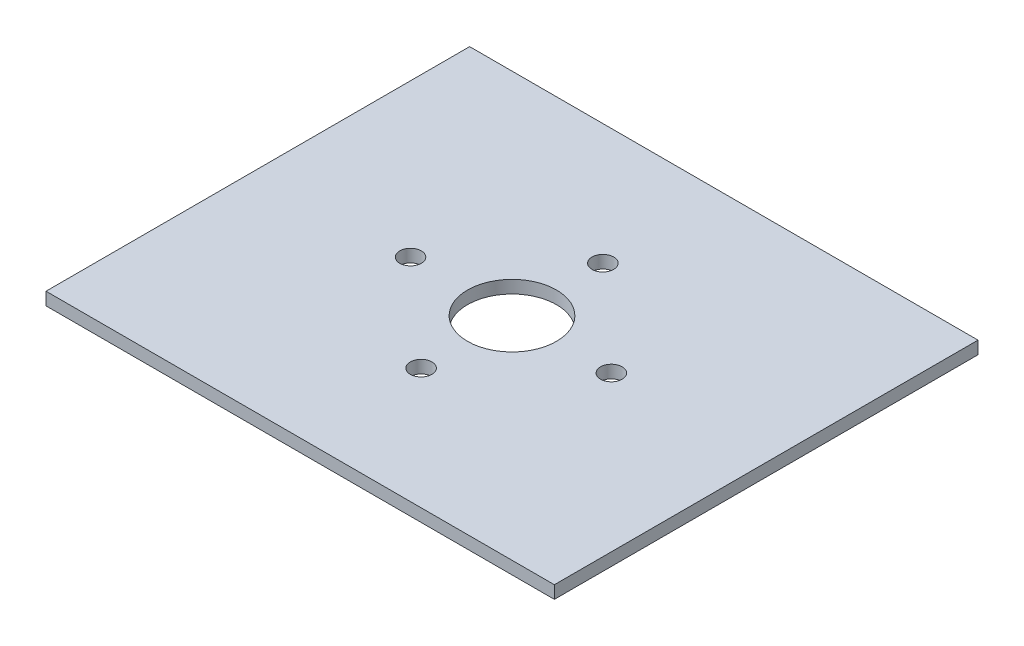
from build123d import *

# Parameters (mm, degrees)
SKETCH1_W           = 120
SKETCH1_H           = 100
SKETCH1_R           = 2.55
BOSS_EXTRUDE1_DEPTH = 3
SKETCH2_R           = 10.5
CUT_EXTRUDE1_DEPTH  = 157.23379916


with BuildPart() as part:
    # Sketch1 → Boss-Extrude1 (new body)
    with BuildSketch(Plane(origin=(0, 0, 0), x_dir=(1, 0, 0), z_dir=(0, 1, 0))):
        with Locations((60, -50)):
            Rectangle(SKETCH1_W, SKETCH1_H)
        with Locations(Location((36.05, -50, 0), (0, 0, 270))):
            Circle(SKETCH1_R, mode=Mode.SUBTRACT)
        with Locations(Location((83.45, -50, 0), (0, 0, 270))):
            Circle(SKETCH1_R, mode=Mode.SUBTRACT)
        with Locations(Location((60, -28.55, 0), (0, 0, 270))):
            Circle(SKETCH1_R, mode=Mode.SUBTRACT)
        with Locations(Location((60, -71.45, 0), (0, 0, 270))):
            Circle(SKETCH1_R, mode=Mode.SUBTRACT)
    extrude(amount=BOSS_EXTRUDE1_DEPTH)

    # Sketch2 → Cut-Extrude1 (cut, through all)
    with BuildSketch(Plane(origin=(0, 3, 0), x_dir=(1, 0, 0), z_dir=(0, 1, 0))):
        with Locations(Location((60, -50, 0), (0, 0, 270))):
            Circle(SKETCH2_R)
    extrude(amount=-CUT_EXTRUDE1_DEPTH, mode=Mode.SUBTRACT)


solid = part.part
